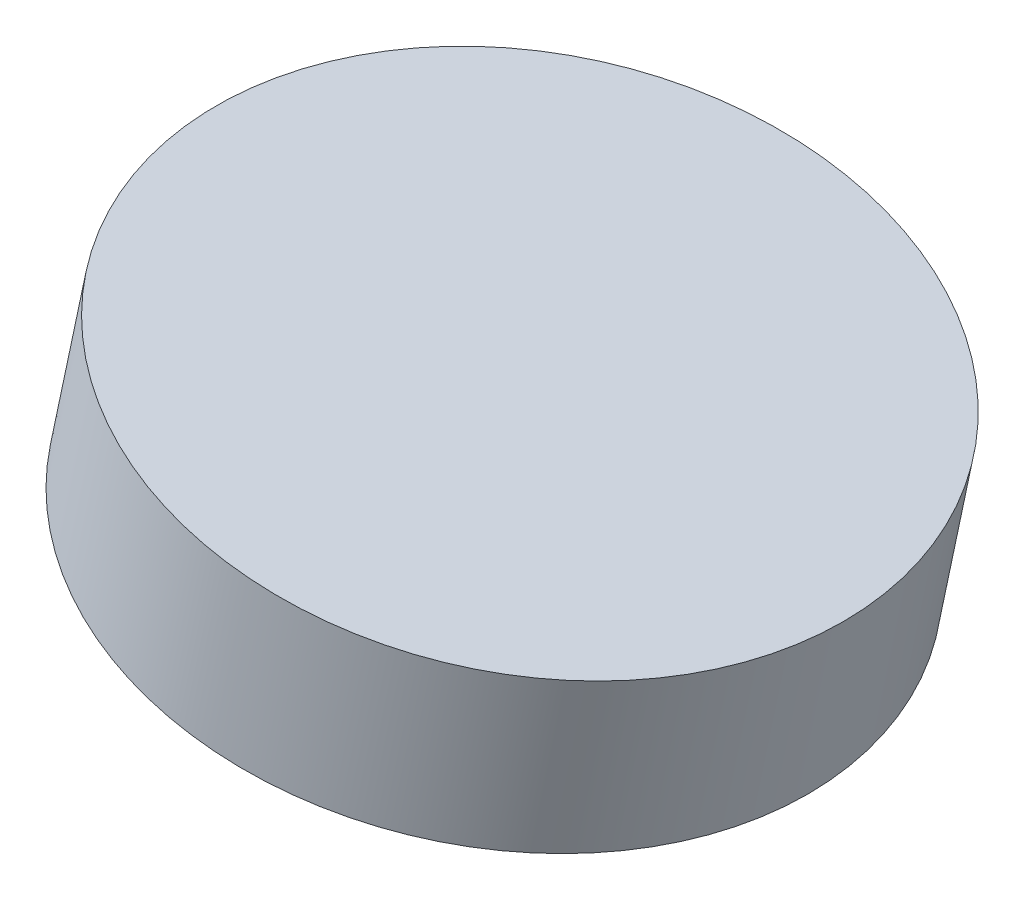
ISO-10303-21;
HEADER;
FILE_DESCRIPTION(('STEP AP214'),'2;1');
FILE_NAME('part.step','',(''),(''),'','','');
FILE_SCHEMA(('AUTOMOTIVE_DESIGN { 1 0 10303 214 1 1 1 1 }'));
ENDSEC;
DATA;
#1=APPLICATION_CONTEXT('core data for automotive mechanical design processes');
#2=APPLICATION_PROTOCOL_DEFINITION('international standard','automotive_design',2000,#1);
#3=PRODUCT_CONTEXT('',#1,'mechanical');
#4=PRODUCT('Part','Part','',(#3));
#5=PRODUCT_RELATED_PRODUCT_CATEGORY('part','',(#4));
#6=PRODUCT_DEFINITION_FORMATION('','',#4);
#7=PRODUCT_DEFINITION_CONTEXT('part definition',#1,'design');
#8=PRODUCT_DEFINITION('design','',#6,#7);
#9=PRODUCT_DEFINITION_SHAPE('','',#8);
#10=(LENGTH_UNIT() NAMED_UNIT(*) SI_UNIT(.MILLI.,.METRE.));
#11=(NAMED_UNIT(*) PLANE_ANGLE_UNIT() SI_UNIT($,.RADIAN.));
#12=(NAMED_UNIT(*) SI_UNIT($,.STERADIAN.) SOLID_ANGLE_UNIT());
#13=UNCERTAINTY_MEASURE_WITH_UNIT(LENGTH_MEASURE(1.E-05),#10,'distance_accuracy_value','');
#14=(GEOMETRIC_REPRESENTATION_CONTEXT(3) GLOBAL_UNCERTAINTY_ASSIGNED_CONTEXT((#13)) GLOBAL_UNIT_ASSIGNED_CONTEXT((#10,
#11,#12)) REPRESENTATION_CONTEXT('',''));
#15=CARTESIAN_POINT('',(0.,0.,0.));
#16=DIRECTION('',(0.,0.,1.));
#17=DIRECTION('',(1.,0.,0.));
#18=AXIS2_PLACEMENT_3D('',#15,#16,#17);
#19=CARTESIAN_POINT('',(-130.08920484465,109.438561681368,0.));
#20=DIRECTION('',(-0.20791169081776,-0.978147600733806,0.));
#21=DIRECTION('',(0.978147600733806,-0.20791169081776,0.));
#22=AXIS2_PLACEMENT_3D('',#19,#20,#21);
#23=PLANE('',#22);
#24=CARTESIAN_POINT('',(16.6329352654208,78.2518080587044,0.));
#25=DIRECTION('',(-0.20791169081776,-0.978147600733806,0.));
#26=DIRECTION('',(0.978147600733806,-0.20791169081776,0.));
#27=AXIS2_PLACEMENT_3D('',#24,#25,#26);
#28=CIRCLE('',#27,150.);
#29=CARTESIAN_POINT('',(163.355075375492,47.0650544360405,0.));
#30=VERTEX_POINT('',#29);
#31=EDGE_CURVE('E137',#30,#30,#28,.T.);
#32=ORIENTED_EDGE('',*,*,#31,.F.);
#33=EDGE_LOOP('',(#32));
#34=FACE_BOUND('',#33,.T.);
#35=ADVANCED_FACE('F24',(#34),#23,.F.);
#36=CARTESIAN_POINT('',(0.,0.,0.));
#37=DIRECTION('',(-0.20791169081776,-0.978147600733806,0.));
#38=DIRECTION('',(0.978147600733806,-0.20791169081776,0.));
#39=AXIS2_PLACEMENT_3D('',#36,#37,#38);
#40=CYLINDRICAL_SURFACE('',#39,150.);
#41=CARTESIAN_POINT('',(0.,0.,0.));
#42=DIRECTION('',(-0.20791169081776,-0.978147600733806,0.));
#43=DIRECTION('',(0.978147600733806,-0.20791169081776,0.));
#44=AXIS2_PLACEMENT_3D('',#41,#42,#43);
#45=CIRCLE('',#44,150.);
#46=CARTESIAN_POINT('',(146.722140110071,-31.186753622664,0.));
#47=VERTEX_POINT('',#46);
#48=EDGE_CURVE('E134',#47,#47,#45,.T.);
#49=ORIENTED_EDGE('',*,*,#48,.F.);
#50=EDGE_LOOP('',(#49));
#51=FACE_BOUND('',#50,.T.);
#52=ORIENTED_EDGE('',*,*,#31,.T.);
#53=EDGE_LOOP('',(#52));
#54=FACE_BOUND('',#53,.T.);
#55=ADVANCED_FACE('F157',(#51,#54),#40,.T.);
#56=CARTESIAN_POINT('',(-146.722140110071,31.186753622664,0.));
#57=DIRECTION('',(0.20791169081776,0.978147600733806,0.));
#58=DIRECTION('',(-0.978147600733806,0.20791169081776,0.));
#59=AXIS2_PLACEMENT_3D('',#56,#57,#58);
#60=PLANE('',#59);
#61=CARTESIAN_POINT('',(0.,0.,0.));
#62=DIRECTION('',(0.20791169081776,0.978147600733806,0.));
#63=DIRECTION('',(-0.978147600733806,0.20791169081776,0.));
#64=AXIS2_PLACEMENT_3D('',#61,#62,#63);
#65=CIRCLE('',#64,51.);
#66=CARTESIAN_POINT('',(-49.8855276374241,10.6034962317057,0.));
#67=VERTEX_POINT('',#66);
#68=EDGE_CURVE('E11',#67,#67,#65,.T.);
#69=ORIENTED_EDGE('',*,*,#68,.T.);
#70=EDGE_LOOP('',(#69));
#71=FACE_BOUND('',#70,.T.);
#72=CARTESIAN_POINT('',(-63.5795940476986,13.5142599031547,-112.583302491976));
#73=DIRECTION('',(-0.20791169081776,-0.978147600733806,0.));
#74=DIRECTION('',(0.978147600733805,-0.20791169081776,0.));
#75=AXIS2_PLACEMENT_3D('',#72,#73,#74);
#76=CIRCLE('',#75,4.);
#77=CARTESIAN_POINT('',(-59.6670036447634,12.6826131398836,-112.583302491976));
#78=VERTEX_POINT('',#77);
#79=EDGE_CURVE('E71',#78,#78,#76,.T.);
#80=ORIENTED_EDGE('',*,*,#79,.F.);
#81=EDGE_LOOP('',(#80));
#82=FACE_BOUND('',#81,.T.);
#83=CARTESIAN_POINT('',(63.5795940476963,-13.5142599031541,-112.583302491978));
#84=DIRECTION('',(-0.20791169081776,-0.978147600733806,0.));
#85=DIRECTION('',(0.978147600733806,-0.20791169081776,0.));
#86=AXIS2_PLACEMENT_3D('',#83,#84,#85);
#87=CIRCLE('',#86,3.99999999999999);
#88=CARTESIAN_POINT('',(67.4921844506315,-14.3459066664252,-112.583302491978));
#89=VERTEX_POINT('',#88);
#90=EDGE_CURVE('E83',#89,#89,#87,.T.);
#91=ORIENTED_EDGE('',*,*,#90,.F.);
#92=EDGE_LOOP('',(#91));
#93=FACE_BOUND('',#92,.T.);
#94=CARTESIAN_POINT('',(127.159188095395,-27.0285198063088,-9.07785673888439E-13));
#95=DIRECTION('',(-0.20791169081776,-0.978147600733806,0.));
#96=DIRECTION('',(0.978147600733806,-0.20791169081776,0.));
#97=AXIS2_PLACEMENT_3D('',#94,#95,#96);
#98=CIRCLE('',#97,4.);
#99=CARTESIAN_POINT('',(131.07177849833,-27.8601665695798,-9.07785673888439E-13));
#100=VERTEX_POINT('',#99);
#101=EDGE_CURVE('E95',#100,#100,#98,.T.);
#102=ORIENTED_EDGE('',*,*,#101,.F.);
#103=EDGE_LOOP('',(#102));
#104=FACE_BOUND('',#103,.T.);
#105=CARTESIAN_POINT('',(63.5795940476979,-13.5142599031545,112.583302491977));
#106=DIRECTION('',(-0.20791169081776,-0.978147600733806,0.));
#107=DIRECTION('',(0.978147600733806,-0.20791169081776,0.));
#108=AXIS2_PLACEMENT_3D('',#105,#106,#107);
#109=CIRCLE('',#108,3.99999999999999);
#110=CARTESIAN_POINT('',(67.4921844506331,-14.3459066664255,112.583302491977));
#111=VERTEX_POINT('',#110);
#112=EDGE_CURVE('E107',#111,#111,#109,.T.);
#113=ORIENTED_EDGE('',*,*,#112,.F.);
#114=EDGE_LOOP('',(#113));
#115=FACE_BOUND('',#114,.T.);
#116=CARTESIAN_POINT('',(-63.5795940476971,13.5142599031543,112.583302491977));
#117=DIRECTION('',(-0.20791169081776,-0.978147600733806,0.));
#118=DIRECTION('',(0.978147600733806,-0.20791169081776,0.));
#119=AXIS2_PLACEMENT_3D('',#116,#117,#118);
#120=CIRCLE('',#119,4.);
#121=CARTESIAN_POINT('',(-59.6670036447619,12.6826131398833,112.583302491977));
#122=VERTEX_POINT('',#121);
#123=EDGE_CURVE('E119',#122,#122,#120,.T.);
#124=ORIENTED_EDGE('',*,*,#123,.F.);
#125=EDGE_LOOP('',(#124));
#126=FACE_BOUND('',#125,.T.);
#127=CARTESIAN_POINT('',(-127.159188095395,27.0285198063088,0.));
#128=DIRECTION('',(-0.20791169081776,-0.978147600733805,0.));
#129=DIRECTION('',(0.978147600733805,-0.20791169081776,0.));
#130=AXIS2_PLACEMENT_3D('',#127,#128,#129);
#131=CIRCLE('',#130,4.);
#132=CARTESIAN_POINT('',(-123.24659769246,26.1968730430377,0.));
#133=VERTEX_POINT('',#132);
#134=EDGE_CURVE('E131',#133,#133,#131,.T.);
#135=ORIENTED_EDGE('',*,*,#134,.F.);
#136=EDGE_LOOP('',(#135));
#137=FACE_BOUND('',#136,.T.);
#138=ORIENTED_EDGE('',*,*,#48,.T.);
#139=EDGE_LOOP('',(#138));
#140=FACE_BOUND('',#139,.T.);
#141=ADVANCED_FACE('F162',(#71,#82,#93,#104,#115,#126,#137,#140),#60,.F.);
#142=CARTESIAN_POINT('',(-127.159188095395,27.0285198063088,0.));
#143=DIRECTION('',(-0.20791169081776,-0.978147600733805,0.));
#144=DIRECTION('',(0.978147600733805,-0.20791169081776,0.));
#145=AXIS2_PLACEMENT_3D('',#142,#143,#144);
#146=CYLINDRICAL_SURFACE('',#145,4.);
#147=CARTESIAN_POINT('',(-120.921837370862,56.3729478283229,0.));
#148=DIRECTION('',(-0.20791169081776,-0.978147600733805,0.));
#149=DIRECTION('',(0.978147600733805,-0.20791169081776,0.));
#150=AXIS2_PLACEMENT_3D('',#147,#148,#149);
#151=CIRCLE('',#150,3.99999999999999);
#152=CARTESIAN_POINT('',(-117.009246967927,55.5413010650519,0.));
#153=VERTEX_POINT('',#152);
#154=EDGE_CURVE('E128',#153,#153,#151,.T.);
#155=ORIENTED_EDGE('',*,*,#154,.F.);
#156=EDGE_LOOP('',(#155));
#157=FACE_BOUND('',#156,.T.);
#158=ORIENTED_EDGE('',*,*,#134,.T.);
#159=EDGE_LOOP('',(#158));
#160=FACE_BOUND('',#159,.T.);
#161=ADVANCED_FACE('F170',(#157,#160),#146,.F.);
#162=CARTESIAN_POINT('',(-120.921837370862,56.3729478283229,3.39999999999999));
#163=DIRECTION('',(0.20791169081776,0.978147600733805,0.));
#164=DIRECTION('',(-0.978147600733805,0.20791169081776,0.));
#165=AXIS2_PLACEMENT_3D('',#162,#163,#164);
#166=PLANE('',#165);
#167=CARTESIAN_POINT('',(-120.921837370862,56.3729478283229,0.));
#168=DIRECTION('',(-0.20791169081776,-0.978147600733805,0.));
#169=DIRECTION('',(0.978147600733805,-0.20791169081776,0.));
#170=AXIS2_PLACEMENT_3D('',#167,#168,#169);
#171=CIRCLE('',#170,3.39999999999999);
#172=CARTESIAN_POINT('',(-117.596135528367,55.6660480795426,0.));
#173=VERTEX_POINT('',#172);
#174=EDGE_CURVE('E125',#173,#173,#171,.T.);
#175=ORIENTED_EDGE('',*,*,#174,.F.);
#176=EDGE_LOOP('',(#175));
#177=FACE_BOUND('',#176,.T.);
#178=ORIENTED_EDGE('',*,*,#154,.T.);
#179=EDGE_LOOP('',(#178));
#180=FACE_BOUND('',#179,.T.);
#181=ADVANCED_FACE('F176',(#177,#180),#166,.F.);
#182=CARTESIAN_POINT('',(-127.159188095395,27.0285198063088,0.));
#183=DIRECTION('',(-0.20791169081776,-0.978147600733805,0.));
#184=DIRECTION('',(0.978147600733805,-0.20791169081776,0.));
#185=AXIS2_PLACEMENT_3D('',#182,#183,#184);
#186=CYLINDRICAL_SURFACE('',#185,3.39999999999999);
#187=CARTESIAN_POINT('',(-119.622389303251,62.4863703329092,0.));
#188=DIRECTION('',(-0.20791169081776,-0.978147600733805,0.));
#189=DIRECTION('',(0.978147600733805,-0.20791169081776,0.));
#190=AXIS2_PLACEMENT_3D('',#187,#188,#189);
#191=CIRCLE('',#190,3.39999999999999);
#192=CARTESIAN_POINT('',(-116.296687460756,61.7794705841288,0.));
#193=VERTEX_POINT('',#192);
#194=EDGE_CURVE('E122',#193,#193,#191,.T.);
#195=ORIENTED_EDGE('',*,*,#194,.F.);
#196=EDGE_LOOP('',(#195));
#197=FACE_BOUND('',#196,.T.);
#198=ORIENTED_EDGE('',*,*,#174,.T.);
#199=EDGE_LOOP('',(#198));
#200=FACE_BOUND('',#199,.T.);
#201=ADVANCED_FACE('F180',(#197,#200),#186,.F.);
#202=CARTESIAN_POINT('',(-119.622389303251,62.4863703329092,0.));
#203=DIRECTION('',(-0.20791169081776,-0.978147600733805,0.));
#204=DIRECTION('',(0.978147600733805,-0.20791169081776,0.));
#205=AXIS2_PLACEMENT_3D('',#202,#203,#204);
#206=CONICAL_SURFACE('',#205,3.39999999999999,1.02974425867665);
#207=CARTESIAN_POINT('',(-119.197641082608,64.4846536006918,0.));
#208=VERTEX_POINT('',#207);
#209=VERTEX_LOOP('',#208);
#210=FACE_BOUND('',#209,.T.);
#211=ORIENTED_EDGE('',*,*,#194,.T.);
#212=EDGE_LOOP('',(#211));
#213=FACE_BOUND('',#212,.T.);
#214=ADVANCED_FACE('F184',(#210,#213),#206,.F.);
#215=CARTESIAN_POINT('',(-63.5795940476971,13.5142599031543,112.583302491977));
#216=DIRECTION('',(-0.20791169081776,-0.978147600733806,0.));
#217=DIRECTION('',(0.978147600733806,-0.20791169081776,0.));
#218=AXIS2_PLACEMENT_3D('',#215,#216,#217);
#219=CYLINDRICAL_SURFACE('',#218,4.);
#220=CARTESIAN_POINT('',(-57.3422433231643,42.8586879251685,112.583302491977));
#221=DIRECTION('',(-0.20791169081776,-0.978147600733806,0.));
#222=DIRECTION('',(0.978147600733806,-0.20791169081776,0.));
#223=AXIS2_PLACEMENT_3D('',#220,#221,#222);
#224=CIRCLE('',#223,3.99999999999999);
#225=CARTESIAN_POINT('',(-53.4296529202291,42.0270411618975,112.583302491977));
#226=VERTEX_POINT('',#225);
#227=EDGE_CURVE('E116',#226,#226,#224,.T.);
#228=ORIENTED_EDGE('',*,*,#227,.F.);
#229=EDGE_LOOP('',(#228));
#230=FACE_BOUND('',#229,.T.);
#231=ORIENTED_EDGE('',*,*,#123,.T.);
#232=EDGE_LOOP('',(#231));
#233=FACE_BOUND('',#232,.T.);
#234=ADVANCED_FACE('F188',(#230,#233),#219,.F.);
#235=CARTESIAN_POINT('',(-57.3422433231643,42.8586879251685,115.983302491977));
#236=DIRECTION('',(0.20791169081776,0.978147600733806,0.));
#237=DIRECTION('',(-0.978147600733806,0.20791169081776,0.));
#238=AXIS2_PLACEMENT_3D('',#235,#236,#237);
#239=PLANE('',#238);
#240=CARTESIAN_POINT('',(-57.3422433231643,42.8586879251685,112.583302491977));
#241=DIRECTION('',(-0.20791169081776,-0.978147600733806,0.));
#242=DIRECTION('',(0.978147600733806,-0.20791169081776,0.));
#243=AXIS2_PLACEMENT_3D('',#240,#241,#242);
#244=CIRCLE('',#243,3.39999999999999);
#245=CARTESIAN_POINT('',(-54.0165414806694,42.1517881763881,112.583302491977));
#246=VERTEX_POINT('',#245);
#247=EDGE_CURVE('E113',#246,#246,#244,.T.);
#248=ORIENTED_EDGE('',*,*,#247,.F.);
#249=EDGE_LOOP('',(#248));
#250=FACE_BOUND('',#249,.T.);
#251=ORIENTED_EDGE('',*,*,#227,.T.);
#252=EDGE_LOOP('',(#251));
#253=FACE_BOUND('',#252,.T.);
#254=ADVANCED_FACE('F191',(#250,#253),#239,.F.);
#255=CARTESIAN_POINT('',(-63.5795940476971,13.5142599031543,112.583302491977));
#256=DIRECTION('',(-0.20791169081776,-0.978147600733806,0.));
#257=DIRECTION('',(0.978147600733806,-0.20791169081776,0.));
#258=AXIS2_PLACEMENT_3D('',#255,#256,#257);
#259=CYLINDRICAL_SURFACE('',#258,3.39999999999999);
#260=CARTESIAN_POINT('',(-56.0427952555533,48.9721104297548,112.583302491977));
#261=DIRECTION('',(-0.20791169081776,-0.978147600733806,0.));
#262=DIRECTION('',(0.978147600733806,-0.20791169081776,0.));
#263=AXIS2_PLACEMENT_3D('',#260,#261,#262);
#264=CIRCLE('',#263,3.39999999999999);
#265=CARTESIAN_POINT('',(-52.7170934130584,48.2652106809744,112.583302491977));
#266=VERTEX_POINT('',#265);
#267=EDGE_CURVE('E110',#266,#266,#264,.T.);
#268=ORIENTED_EDGE('',*,*,#267,.F.);
#269=EDGE_LOOP('',(#268));
#270=FACE_BOUND('',#269,.T.);
#271=ORIENTED_EDGE('',*,*,#247,.T.);
#272=EDGE_LOOP('',(#271));
#273=FACE_BOUND('',#272,.T.);
#274=ADVANCED_FACE('F195',(#270,#273),#259,.F.);
#275=CARTESIAN_POINT('',(-56.0427952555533,48.9721104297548,112.583302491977));
#276=DIRECTION('',(-0.20791169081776,-0.978147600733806,0.));
#277=DIRECTION('',(0.978147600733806,-0.20791169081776,0.));
#278=AXIS2_PLACEMENT_3D('',#275,#276,#277);
#279=CONICAL_SURFACE('',#278,3.39999999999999,1.02974425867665);
#280=CARTESIAN_POINT('',(-55.6180470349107,50.9703936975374,112.583302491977));
#281=VERTEX_POINT('',#280);
#282=VERTEX_LOOP('',#281);
#283=FACE_BOUND('',#282,.T.);
#284=ORIENTED_EDGE('',*,*,#267,.T.);
#285=EDGE_LOOP('',(#284));
#286=FACE_BOUND('',#285,.T.);
#287=ADVANCED_FACE('F199',(#283,#286),#279,.F.);
#288=CARTESIAN_POINT('',(63.5795940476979,-13.5142599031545,112.583302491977));
#289=DIRECTION('',(-0.20791169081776,-0.978147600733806,0.));
#290=DIRECTION('',(0.978147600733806,-0.20791169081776,0.));
#291=AXIS2_PLACEMENT_3D('',#288,#289,#290);
#292=CYLINDRICAL_SURFACE('',#291,3.99999999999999);
#293=CARTESIAN_POINT('',(69.8169447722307,15.8301681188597,112.583302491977));
#294=DIRECTION('',(-0.20791169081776,-0.978147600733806,0.));
#295=DIRECTION('',(0.978147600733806,-0.20791169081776,0.));
#296=AXIS2_PLACEMENT_3D('',#293,#294,#295);
#297=CIRCLE('',#296,3.99999999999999);
#298=CARTESIAN_POINT('',(73.7295351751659,14.9985213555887,112.583302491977));
#299=VERTEX_POINT('',#298);
#300=EDGE_CURVE('E104',#299,#299,#297,.T.);
#301=ORIENTED_EDGE('',*,*,#300,.F.);
#302=EDGE_LOOP('',(#301));
#303=FACE_BOUND('',#302,.T.);
#304=ORIENTED_EDGE('',*,*,#112,.T.);
#305=EDGE_LOOP('',(#304));
#306=FACE_BOUND('',#305,.T.);
#307=ADVANCED_FACE('F203',(#303,#306),#292,.F.);
#308=CARTESIAN_POINT('',(69.8169447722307,15.8301681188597,115.983302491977));
#309=DIRECTION('',(0.20791169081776,0.978147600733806,0.));
#310=DIRECTION('',(-0.978147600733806,0.20791169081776,0.));
#311=AXIS2_PLACEMENT_3D('',#308,#309,#310);
#312=PLANE('',#311);
#313=CARTESIAN_POINT('',(69.8169447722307,15.8301681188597,112.583302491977));
#314=DIRECTION('',(-0.20791169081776,-0.978147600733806,0.));
#315=DIRECTION('',(0.978147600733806,-0.20791169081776,0.));
#316=AXIS2_PLACEMENT_3D('',#313,#314,#315);
#317=CIRCLE('',#316,3.39999999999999);
#318=CARTESIAN_POINT('',(73.1426466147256,15.1232683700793,112.583302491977));
#319=VERTEX_POINT('',#318);
#320=EDGE_CURVE('E101',#319,#319,#317,.T.);
#321=ORIENTED_EDGE('',*,*,#320,.F.);
#322=EDGE_LOOP('',(#321));
#323=FACE_BOUND('',#322,.T.);
#324=ORIENTED_EDGE('',*,*,#300,.T.);
#325=EDGE_LOOP('',(#324));
#326=FACE_BOUND('',#325,.T.);
#327=ADVANCED_FACE('F206',(#323,#326),#312,.F.);
#328=CARTESIAN_POINT('',(63.5795940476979,-13.5142599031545,112.583302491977));
#329=DIRECTION('',(-0.20791169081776,-0.978147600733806,0.));
#330=DIRECTION('',(0.978147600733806,-0.20791169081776,0.));
#331=AXIS2_PLACEMENT_3D('',#328,#329,#330);
#332=CYLINDRICAL_SURFACE('',#331,3.39999999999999);
#333=CARTESIAN_POINT('',(71.1163928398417,21.943590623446,112.583302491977));
#334=DIRECTION('',(-0.20791169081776,-0.978147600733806,0.));
#335=DIRECTION('',(0.978147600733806,-0.20791169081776,0.));
#336=AXIS2_PLACEMENT_3D('',#333,#334,#335);
#337=CIRCLE('',#336,3.39999999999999);
#338=CARTESIAN_POINT('',(74.4420946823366,21.2366908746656,112.583302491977));
#339=VERTEX_POINT('',#338);
#340=EDGE_CURVE('E98',#339,#339,#337,.T.);
#341=ORIENTED_EDGE('',*,*,#340,.F.);
#342=EDGE_LOOP('',(#341));
#343=FACE_BOUND('',#342,.T.);
#344=ORIENTED_EDGE('',*,*,#320,.T.);
#345=EDGE_LOOP('',(#344));
#346=FACE_BOUND('',#345,.T.);
#347=ADVANCED_FACE('F210',(#343,#346),#332,.F.);
#348=CARTESIAN_POINT('',(71.1163928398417,21.943590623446,112.583302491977));
#349=DIRECTION('',(-0.20791169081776,-0.978147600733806,0.));
#350=DIRECTION('',(0.978147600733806,-0.20791169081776,0.));
#351=AXIS2_PLACEMENT_3D('',#348,#349,#350);
#352=CONICAL_SURFACE('',#351,3.39999999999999,1.02974425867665);
#353=CARTESIAN_POINT('',(71.5411410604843,23.9418738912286,112.583302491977));
#354=VERTEX_POINT('',#353);
#355=VERTEX_LOOP('',#354);
#356=FACE_BOUND('',#355,.T.);
#357=ORIENTED_EDGE('',*,*,#340,.T.);
#358=EDGE_LOOP('',(#357));
#359=FACE_BOUND('',#358,.T.);
#360=ADVANCED_FACE('F214',(#356,#359),#352,.F.);
#361=CARTESIAN_POINT('',(127.159188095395,-27.0285198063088,-9.07785673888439E-13));
#362=DIRECTION('',(-0.20791169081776,-0.978147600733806,0.));
#363=DIRECTION('',(0.978147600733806,-0.20791169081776,0.));
#364=AXIS2_PLACEMENT_3D('',#361,#362,#363);
#365=CYLINDRICAL_SURFACE('',#364,4.);
#366=CARTESIAN_POINT('',(133.396538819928,2.31590821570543,-9.07785673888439E-13));
#367=DIRECTION('',(-0.20791169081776,-0.978147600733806,0.));
#368=DIRECTION('',(0.978147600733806,-0.20791169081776,0.));
#369=AXIS2_PLACEMENT_3D('',#366,#367,#368);
#370=CIRCLE('',#369,4.);
#371=CARTESIAN_POINT('',(137.309129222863,1.48426145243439,-9.07785673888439E-13));
#372=VERTEX_POINT('',#371);
#373=EDGE_CURVE('E92',#372,#372,#370,.T.);
#374=ORIENTED_EDGE('',*,*,#373,.F.);
#375=EDGE_LOOP('',(#374));
#376=FACE_BOUND('',#375,.T.);
#377=ORIENTED_EDGE('',*,*,#101,.T.);
#378=EDGE_LOOP('',(#377));
#379=FACE_BOUND('',#378,.T.);
#380=ADVANCED_FACE('F218',(#376,#379),#365,.F.);
#381=CARTESIAN_POINT('',(133.396538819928,2.31590821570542,3.39999999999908));
#382=DIRECTION('',(0.20791169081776,0.978147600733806,0.));
#383=DIRECTION('',(-0.978147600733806,0.20791169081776,0.));
#384=AXIS2_PLACEMENT_3D('',#381,#382,#383);
#385=PLANE('',#384);
#386=CARTESIAN_POINT('',(133.396538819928,2.31590821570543,-9.07785673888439E-13));
#387=DIRECTION('',(-0.20791169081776,-0.978147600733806,0.));
#388=DIRECTION('',(0.978147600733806,-0.20791169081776,0.));
#389=AXIS2_PLACEMENT_3D('',#386,#387,#388);
#390=CIRCLE('',#389,3.39999999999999);
#391=CARTESIAN_POINT('',(136.722240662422,1.60900846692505,-9.07785673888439E-13));
#392=VERTEX_POINT('',#391);
#393=EDGE_CURVE('E89',#392,#392,#390,.T.);
#394=ORIENTED_EDGE('',*,*,#393,.F.);
#395=EDGE_LOOP('',(#394));
#396=FACE_BOUND('',#395,.T.);
#397=ORIENTED_EDGE('',*,*,#373,.T.);
#398=EDGE_LOOP('',(#397));
#399=FACE_BOUND('',#398,.T.);
#400=ADVANCED_FACE('F222',(#396,#399),#385,.F.);
#401=CARTESIAN_POINT('',(127.159188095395,-27.0285198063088,-9.07785673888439E-13));
#402=DIRECTION('',(-0.20791169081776,-0.978147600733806,0.));
#403=DIRECTION('',(0.978147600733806,-0.20791169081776,0.));
#404=AXIS2_PLACEMENT_3D('',#401,#402,#403);
#405=CYLINDRICAL_SURFACE('',#404,3.39999999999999);
#406=CARTESIAN_POINT('',(134.695986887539,8.42933072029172,-9.07785673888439E-13));
#407=DIRECTION('',(-0.20791169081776,-0.978147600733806,0.));
#408=DIRECTION('',(0.978147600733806,-0.20791169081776,0.));
#409=AXIS2_PLACEMENT_3D('',#406,#407,#408);
#410=CIRCLE('',#409,3.39999999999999);
#411=CARTESIAN_POINT('',(138.021688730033,7.72243097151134,-9.07785673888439E-13));
#412=VERTEX_POINT('',#411);
#413=EDGE_CURVE('E86',#412,#412,#410,.T.);
#414=ORIENTED_EDGE('',*,*,#413,.F.);
#415=EDGE_LOOP('',(#414));
#416=FACE_BOUND('',#415,.T.);
#417=ORIENTED_EDGE('',*,*,#393,.T.);
#418=EDGE_LOOP('',(#417));
#419=FACE_BOUND('',#418,.T.);
#420=ADVANCED_FACE('F226',(#416,#419),#405,.F.);
#421=CARTESIAN_POINT('',(134.695986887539,8.42933072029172,-9.07785673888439E-13));
#422=DIRECTION('',(-0.20791169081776,-0.978147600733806,0.));
#423=DIRECTION('',(0.978147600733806,-0.20791169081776,0.));
#424=AXIS2_PLACEMENT_3D('',#421,#422,#423);
#425=CONICAL_SURFACE('',#424,3.39999999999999,1.02974425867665);
#426=CARTESIAN_POINT('',(135.120735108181,10.4276139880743,-9.17164426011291E-13));
#427=VERTEX_POINT('',#426);
#428=VERTEX_LOOP('',#427);
#429=FACE_BOUND('',#428,.T.);
#430=ORIENTED_EDGE('',*,*,#413,.T.);
#431=EDGE_LOOP('',(#430));
#432=FACE_BOUND('',#431,.T.);
#433=ADVANCED_FACE('F230',(#429,#432),#425,.F.);
#434=CARTESIAN_POINT('',(63.5795940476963,-13.5142599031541,-112.583302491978));
#435=DIRECTION('',(-0.20791169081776,-0.978147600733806,0.));
#436=DIRECTION('',(0.978147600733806,-0.20791169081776,0.));
#437=AXIS2_PLACEMENT_3D('',#434,#435,#436);
#438=CYLINDRICAL_SURFACE('',#437,3.99999999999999);
#439=CARTESIAN_POINT('',(69.8169447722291,15.83016811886,-112.583302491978));
#440=DIRECTION('',(-0.20791169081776,-0.978147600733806,0.));
#441=DIRECTION('',(0.978147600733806,-0.20791169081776,0.));
#442=AXIS2_PLACEMENT_3D('',#439,#440,#441);
#443=CIRCLE('',#442,3.99999999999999);
#444=CARTESIAN_POINT('',(73.7295351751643,14.998521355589,-112.583302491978));
#445=VERTEX_POINT('',#444);
#446=EDGE_CURVE('E80',#445,#445,#443,.T.);
#447=ORIENTED_EDGE('',*,*,#446,.F.);
#448=EDGE_LOOP('',(#447));
#449=FACE_BOUND('',#448,.T.);
#450=ORIENTED_EDGE('',*,*,#90,.T.);
#451=EDGE_LOOP('',(#450));
#452=FACE_BOUND('',#451,.T.);
#453=ADVANCED_FACE('F234',(#449,#452),#438,.F.);
#454=CARTESIAN_POINT('',(69.8169447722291,15.83016811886,-109.183302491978));
#455=DIRECTION('',(0.20791169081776,0.978147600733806,0.));
#456=DIRECTION('',(-0.978147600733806,0.20791169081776,0.));
#457=AXIS2_PLACEMENT_3D('',#454,#455,#456);
#458=PLANE('',#457);
#459=CARTESIAN_POINT('',(69.8169447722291,15.83016811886,-112.583302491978));
#460=DIRECTION('',(-0.20791169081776,-0.978147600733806,0.));
#461=DIRECTION('',(0.978147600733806,-0.20791169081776,0.));
#462=AXIS2_PLACEMENT_3D('',#459,#460,#461);
#463=CIRCLE('',#462,3.39999999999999);
#464=CARTESIAN_POINT('',(73.1426466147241,15.1232683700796,-112.583302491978));
#465=VERTEX_POINT('',#464);
#466=EDGE_CURVE('E77',#465,#465,#463,.T.);
#467=ORIENTED_EDGE('',*,*,#466,.F.);
#468=EDGE_LOOP('',(#467));
#469=FACE_BOUND('',#468,.T.);
#470=ORIENTED_EDGE('',*,*,#446,.T.);
#471=EDGE_LOOP('',(#470));
#472=FACE_BOUND('',#471,.T.);
#473=ADVANCED_FACE('F238',(#469,#472),#458,.F.);
#474=CARTESIAN_POINT('',(63.5795940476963,-13.5142599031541,-112.583302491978));
#475=DIRECTION('',(-0.20791169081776,-0.978147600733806,0.));
#476=DIRECTION('',(0.978147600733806,-0.20791169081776,0.));
#477=AXIS2_PLACEMENT_3D('',#474,#475,#476);
#478=CYLINDRICAL_SURFACE('',#477,3.39999999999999);
#479=CARTESIAN_POINT('',(71.1163928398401,21.9435906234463,-112.583302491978));
#480=DIRECTION('',(-0.20791169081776,-0.978147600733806,0.));
#481=DIRECTION('',(0.978147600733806,-0.20791169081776,0.));
#482=AXIS2_PLACEMENT_3D('',#479,#480,#481);
#483=CIRCLE('',#482,3.39999999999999);
#484=CARTESIAN_POINT('',(74.4420946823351,21.2366908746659,-112.583302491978));
#485=VERTEX_POINT('',#484);
#486=EDGE_CURVE('E74',#485,#485,#483,.T.);
#487=ORIENTED_EDGE('',*,*,#486,.F.);
#488=EDGE_LOOP('',(#487));
#489=FACE_BOUND('',#488,.T.);
#490=ORIENTED_EDGE('',*,*,#466,.T.);
#491=EDGE_LOOP('',(#490));
#492=FACE_BOUND('',#491,.T.);
#493=ADVANCED_FACE('F242',(#489,#492),#478,.F.);
#494=CARTESIAN_POINT('',(71.1163928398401,21.9435906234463,-112.583302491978));
#495=DIRECTION('',(-0.20791169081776,-0.978147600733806,0.));
#496=DIRECTION('',(0.978147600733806,-0.20791169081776,0.));
#497=AXIS2_PLACEMENT_3D('',#494,#495,#496);
#498=CONICAL_SURFACE('',#497,3.39999999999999,1.02974425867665);
#499=CARTESIAN_POINT('',(71.5411410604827,23.9418738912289,-112.583302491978));
#500=VERTEX_POINT('',#499);
#501=VERTEX_LOOP('',#500);
#502=FACE_BOUND('',#501,.T.);
#503=ORIENTED_EDGE('',*,*,#486,.T.);
#504=EDGE_LOOP('',(#503));
#505=FACE_BOUND('',#504,.T.);
#506=ADVANCED_FACE('F246',(#502,#505),#498,.F.);
#507=CARTESIAN_POINT('',(-63.5795940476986,13.5142599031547,-112.583302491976));
#508=DIRECTION('',(-0.20791169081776,-0.978147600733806,0.));
#509=DIRECTION('',(0.978147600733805,-0.20791169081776,0.));
#510=AXIS2_PLACEMENT_3D('',#507,#508,#509);
#511=CYLINDRICAL_SURFACE('',#510,4.);
#512=CARTESIAN_POINT('',(-57.3422433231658,42.8586879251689,-112.583302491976));
#513=DIRECTION('',(-0.20791169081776,-0.978147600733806,0.));
#514=DIRECTION('',(0.978147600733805,-0.20791169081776,0.));
#515=AXIS2_PLACEMENT_3D('',#512,#513,#514);
#516=CIRCLE('',#515,3.99999999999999);
#517=CARTESIAN_POINT('',(-53.4296529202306,42.0270411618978,-112.583302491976));
#518=VERTEX_POINT('',#517);
#519=EDGE_CURVE('E64',#518,#518,#516,.T.);
#520=ORIENTED_EDGE('',*,*,#519,.F.);
#521=EDGE_LOOP('',(#520));
#522=FACE_BOUND('',#521,.T.);
#523=ORIENTED_EDGE('',*,*,#79,.T.);
#524=EDGE_LOOP('',(#523));
#525=FACE_BOUND('',#524,.T.);
#526=ADVANCED_FACE('F250',(#522,#525),#511,.F.);
#527=CARTESIAN_POINT('',(-57.3422433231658,42.8586879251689,-109.183302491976));
#528=DIRECTION('',(0.20791169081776,0.978147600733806,0.));
#529=DIRECTION('',(-0.978147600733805,0.20791169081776,0.));
#530=AXIS2_PLACEMENT_3D('',#527,#528,#529);
#531=PLANE('',#530);
#532=CARTESIAN_POINT('',(-57.3422433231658,42.8586879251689,-112.583302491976));
#533=DIRECTION('',(-0.20791169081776,-0.978147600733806,0.));
#534=DIRECTION('',(0.978147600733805,-0.20791169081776,0.));
#535=AXIS2_PLACEMENT_3D('',#532,#533,#534);
#536=CIRCLE('',#535,3.39999999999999);
#537=CARTESIAN_POINT('',(-54.0165414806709,42.1517881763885,-112.583302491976));
#538=VERTEX_POINT('',#537);
#539=EDGE_CURVE('E60',#538,#538,#536,.T.);
#540=ORIENTED_EDGE('',*,*,#539,.F.);
#541=EDGE_LOOP('',(#540));
#542=FACE_BOUND('',#541,.T.);
#543=ORIENTED_EDGE('',*,*,#519,.T.);
#544=EDGE_LOOP('',(#543));
#545=FACE_BOUND('',#544,.T.);
#546=ADVANCED_FACE('F254',(#542,#545),#531,.F.);
#547=CARTESIAN_POINT('',(-63.5795940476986,13.5142599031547,-112.583302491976));
#548=DIRECTION('',(-0.20791169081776,-0.978147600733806,0.));
#549=DIRECTION('',(0.978147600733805,-0.20791169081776,0.));
#550=AXIS2_PLACEMENT_3D('',#547,#548,#549);
#551=CYLINDRICAL_SURFACE('',#550,3.39999999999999);
#552=CARTESIAN_POINT('',(-56.0427952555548,48.9721104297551,-112.583302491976));
#553=DIRECTION('',(-0.20791169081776,-0.978147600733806,0.));
#554=DIRECTION('',(0.978147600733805,-0.20791169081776,0.));
#555=AXIS2_PLACEMENT_3D('',#552,#553,#554);
#556=CIRCLE('',#555,3.39999999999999);
#557=CARTESIAN_POINT('',(-52.7170934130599,48.2652106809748,-112.583302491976));
#558=VERTEX_POINT('',#557);
#559=EDGE_CURVE('E58',#558,#558,#556,.T.);
#560=ORIENTED_EDGE('',*,*,#559,.F.);
#561=EDGE_LOOP('',(#560));
#562=FACE_BOUND('',#561,.T.);
#563=ORIENTED_EDGE('',*,*,#539,.T.);
#564=EDGE_LOOP('',(#563));
#565=FACE_BOUND('',#564,.T.);
#566=ADVANCED_FACE('F54',(#562,#565),#551,.F.);
#567=CARTESIAN_POINT('',(-56.0427952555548,48.9721104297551,-112.583302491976));
#568=DIRECTION('',(-0.20791169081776,-0.978147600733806,0.));
#569=DIRECTION('',(0.978147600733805,-0.20791169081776,0.));
#570=AXIS2_PLACEMENT_3D('',#567,#568,#569);
#571=CONICAL_SURFACE('',#570,3.39999999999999,1.02974425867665);
#572=CARTESIAN_POINT('',(-55.6180470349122,50.9703936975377,-112.583302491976));
#573=VERTEX_POINT('',#572);
#574=VERTEX_LOOP('',#573);
#575=FACE_BOUND('',#574,.T.);
#576=ORIENTED_EDGE('',*,*,#559,.T.);
#577=EDGE_LOOP('',(#576));
#578=FACE_BOUND('',#577,.T.);
#579=ADVANCED_FACE('F50',(#575,#578),#571,.F.);
#580=CARTESIAN_POINT('',(2.0791169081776,9.78147600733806,0.));
#581=DIRECTION('',(-0.20791169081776,-0.978147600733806,0.));
#582=DIRECTION('',(0.978147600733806,-0.20791169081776,0.));
#583=AXIS2_PLACEMENT_3D('',#580,#581,#582);
#584=CYLINDRICAL_SURFACE('',#583,50.);
#585=CARTESIAN_POINT('',(0.207911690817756,0.978147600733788,0.));
#586=DIRECTION('',(0.20791169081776,0.978147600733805,0.));
#587=DIRECTION('',(-0.978147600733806,0.20791169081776,0.));
#588=AXIS2_PLACEMENT_3D('',#585,#586,#587);
#589=CIRCLE('',#588,50.);
#590=CARTESIAN_POINT('',(-48.6994683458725,11.3737321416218,0.));
#591=VERTEX_POINT('',#590);
#592=EDGE_CURVE('E31',#591,#591,#589,.F.);
#593=ORIENTED_EDGE('',*,*,#592,.T.);
#594=EDGE_LOOP('',(#593));
#595=FACE_BOUND('',#594,.T.);
#596=CARTESIAN_POINT('',(2.0791169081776,9.78147600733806,0.));
#597=DIRECTION('',(-0.20791169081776,-0.978147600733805,0.));
#598=DIRECTION('',(0.978147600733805,-0.20791169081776,0.));
#599=AXIS2_PLACEMENT_3D('',#596,#597,#598);
#600=CIRCLE('',#599,50.);
#601=CARTESIAN_POINT('',(50.9864969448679,-0.614108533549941,0.));
#602=VERTEX_POINT('',#601);
#603=EDGE_CURVE('E61',#602,#602,#600,.T.);
#604=ORIENTED_EDGE('',*,*,#603,.F.);
#605=EDGE_LOOP('',(#604));
#606=FACE_BOUND('',#605,.T.);
#607=ADVANCED_FACE('F53',(#595,#606),#584,.F.);
#608=CARTESIAN_POINT('',(2.0791169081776,9.78147600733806,0.));
#609=DIRECTION('',(-0.20791169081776,-0.978147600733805,0.));
#610=DIRECTION('',(0.978147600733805,-0.20791169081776,0.));
#611=AXIS2_PLACEMENT_3D('',#608,#609,#610);
#612=PLANE('',#611);
#613=ORIENTED_EDGE('',*,*,#603,.T.);
#614=EDGE_LOOP('',(#613));
#615=FACE_BOUND('',#614,.T.);
#616=ADVANCED_FACE('F146',(#615),#612,.T.);
#617=CARTESIAN_POINT('',(0.207911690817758,0.978147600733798,0.));
#618=DIRECTION('',(-0.20791169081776,-0.978147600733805,0.));
#619=DIRECTION('',(0.978147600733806,-0.20791169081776,0.));
#620=AXIS2_PLACEMENT_3D('',#617,#618,#619);
#621=CONICAL_SURFACE('',#620,50.,0.785398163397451);
#622=ORIENTED_EDGE('',*,*,#68,.F.);
#623=EDGE_LOOP('',(#622));
#624=FACE_BOUND('',#623,.T.);
#625=ORIENTED_EDGE('',*,*,#592,.F.);
#626=EDGE_LOOP('',(#625));
#627=FACE_BOUND('',#626,.T.);
#628=ADVANCED_FACE('F144',(#624,#627),#621,.F.);
#629=CLOSED_SHELL('',(#35,#55,#141,#161,#181,#201,#214,#234,#254,#274,#287,#307,#327,#347,#360,
#380,#400,#420,#433,#453,#473,#493,#506,#526,#546,#566,#579,#607,#616,#628));
#630=MANIFOLD_SOLID_BREP('B2',#629);
#631=ADVANCED_BREP_SHAPE_REPRESENTATION('',(#18,#630),#14);
#632=SHAPE_DEFINITION_REPRESENTATION(#9,#631);
ENDSEC;
END-ISO-10303-21;
